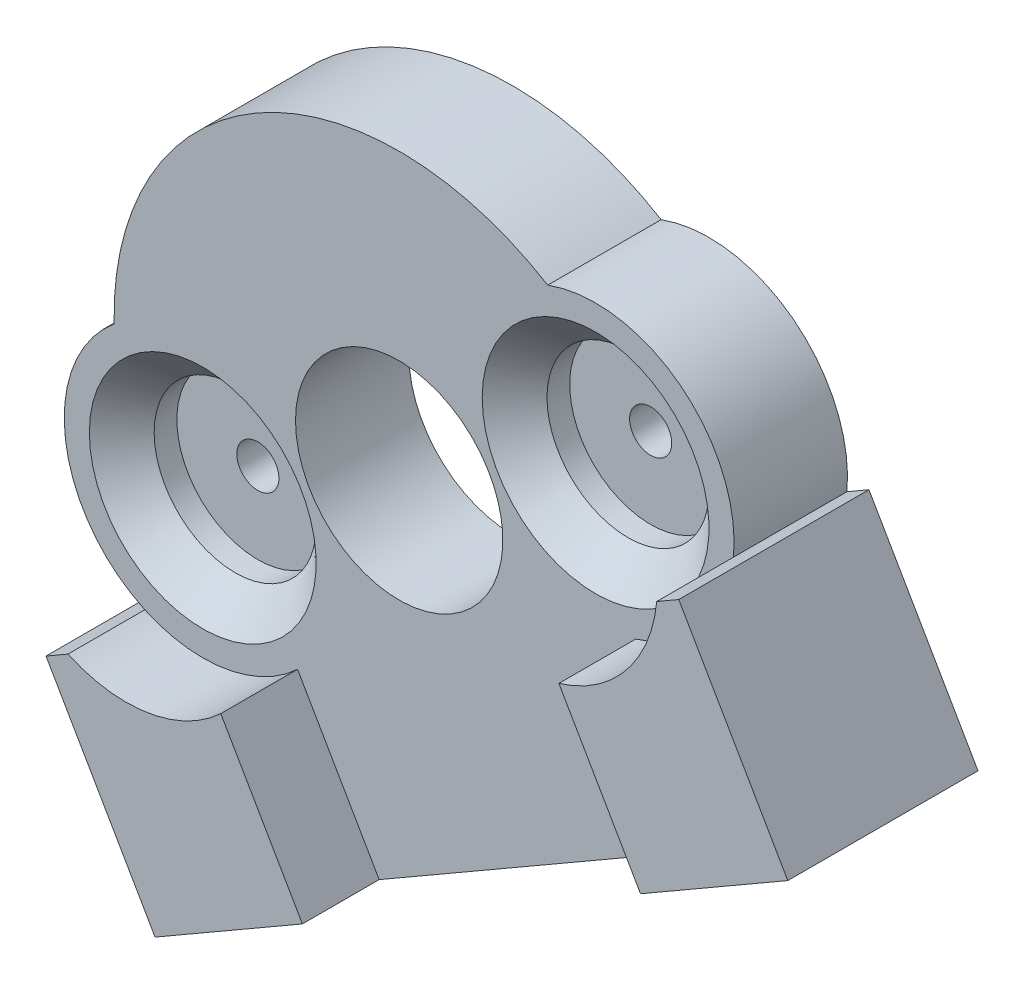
ISO-10303-21;
HEADER;
FILE_DESCRIPTION(('STEP AP214'),'2;1');
FILE_NAME('part.step','',(''),(''),'','','');
FILE_SCHEMA(('AUTOMOTIVE_DESIGN { 1 0 10303 214 1 1 1 1 }'));
ENDSEC;
DATA;
#1=APPLICATION_CONTEXT('core data for automotive mechanical design processes');
#2=APPLICATION_PROTOCOL_DEFINITION('international standard','automotive_design',2000,#1);
#3=PRODUCT_CONTEXT('',#1,'mechanical');
#4=PRODUCT('Part','Part','',(#3));
#5=PRODUCT_RELATED_PRODUCT_CATEGORY('part','',(#4));
#6=PRODUCT_DEFINITION_FORMATION('','',#4);
#7=PRODUCT_DEFINITION_CONTEXT('part definition',#1,'design');
#8=PRODUCT_DEFINITION('design','',#6,#7);
#9=PRODUCT_DEFINITION_SHAPE('','',#8);
#10=(LENGTH_UNIT() NAMED_UNIT(*) SI_UNIT(.MILLI.,.METRE.));
#11=(NAMED_UNIT(*) PLANE_ANGLE_UNIT() SI_UNIT($,.RADIAN.));
#12=(NAMED_UNIT(*) SI_UNIT($,.STERADIAN.) SOLID_ANGLE_UNIT());
#13=UNCERTAINTY_MEASURE_WITH_UNIT(LENGTH_MEASURE(1.E-05),#10,'distance_accuracy_value','');
#14=(GEOMETRIC_REPRESENTATION_CONTEXT(3) GLOBAL_UNCERTAINTY_ASSIGNED_CONTEXT((#13)) GLOBAL_UNIT_ASSIGNED_CONTEXT((#10,
#11,#12)) REPRESENTATION_CONTEXT('',''));
#15=CARTESIAN_POINT('',(0.,0.,0.));
#16=DIRECTION('',(0.,0.,1.));
#17=DIRECTION('',(1.,0.,0.));
#18=AXIS2_PLACEMENT_3D('',#15,#16,#17);
#19=CARTESIAN_POINT('',(-6.06217782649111,-3.49999999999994,5.87));
#20=DIRECTION('',(0.,0.,-1.));
#21=DIRECTION('',(-1.,0.,0.));
#22=AXIS2_PLACEMENT_3D('',#19,#20,#21);
#23=CYLINDRICAL_SURFACE('',#22,0.650000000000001);
#24=CARTESIAN_POINT('',(-6.06217782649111,-3.49999999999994,0.));
#25=DIRECTION('',(0.,0.,1.));
#26=DIRECTION('',(1.,0.,0.));
#27=AXIS2_PLACEMENT_3D('',#24,#25,#26);
#28=CIRCLE('',#27,0.650000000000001);
#29=CARTESIAN_POINT('',(-5.4121778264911,-3.49999999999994,0.));
#30=VERTEX_POINT('',#29);
#31=EDGE_CURVE('E172',#30,#30,#28,.T.);
#32=ORIENTED_EDGE('',*,*,#31,.F.);
#33=EDGE_LOOP('',(#32));
#34=FACE_BOUND('',#33,.T.);
#35=CARTESIAN_POINT('',(-6.06217782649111,-3.49999999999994,1.8));
#36=DIRECTION('',(0.,0.,1.));
#37=DIRECTION('',(1.,0.,0.));
#38=AXIS2_PLACEMENT_3D('',#35,#36,#37);
#39=CIRCLE('',#38,0.650000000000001);
#40=CARTESIAN_POINT('',(-5.4121778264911,-3.49999999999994,1.8));
#41=VERTEX_POINT('',#40);
#42=EDGE_CURVE('E241',#41,#41,#39,.T.);
#43=ORIENTED_EDGE('',*,*,#42,.T.);
#44=EDGE_LOOP('',(#43));
#45=FACE_BOUND('',#44,.T.);
#46=ADVANCED_FACE('F28',(#34,#45),#23,.F.);
#47=CARTESIAN_POINT('',(6.06217782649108,3.49999999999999,5.87));
#48=DIRECTION('',(0.,0.,-1.));
#49=DIRECTION('',(-1.,0.,0.));
#50=AXIS2_PLACEMENT_3D('',#47,#48,#49);
#51=CYLINDRICAL_SURFACE('',#50,0.650000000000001);
#52=CARTESIAN_POINT('',(6.06217782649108,3.49999999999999,0.));
#53=DIRECTION('',(0.,0.,1.));
#54=DIRECTION('',(1.,0.,0.));
#55=AXIS2_PLACEMENT_3D('',#52,#53,#54);
#56=CIRCLE('',#55,0.650000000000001);
#57=CARTESIAN_POINT('',(6.71217782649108,3.49999999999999,0.));
#58=VERTEX_POINT('',#57);
#59=EDGE_CURVE('E175',#58,#58,#56,.T.);
#60=ORIENTED_EDGE('',*,*,#59,.F.);
#61=EDGE_LOOP('',(#60));
#62=FACE_BOUND('',#61,.T.);
#63=CARTESIAN_POINT('',(6.06217782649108,3.49999999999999,1.8));
#64=DIRECTION('',(0.,0.,1.));
#65=DIRECTION('',(1.,0.,0.));
#66=AXIS2_PLACEMENT_3D('',#63,#64,#65);
#67=CIRCLE('',#66,0.650000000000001);
#68=CARTESIAN_POINT('',(6.71217782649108,3.49999999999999,1.8));
#69=VERTEX_POINT('',#68);
#70=EDGE_CURVE('E236',#69,#69,#67,.T.);
#71=ORIENTED_EDGE('',*,*,#70,.T.);
#72=EDGE_LOOP('',(#71));
#73=FACE_BOUND('',#72,.T.);
#74=ADVANCED_FACE('F351',(#62,#73),#51,.F.);
#75=CARTESIAN_POINT('',(-6.06217782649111,-3.49999999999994,5.87));
#76=DIRECTION('',(0.,0.,-1.));
#77=DIRECTION('',(-1.,0.,0.));
#78=AXIS2_PLACEMENT_3D('',#75,#76,#77);
#79=PLANE('',#78);
#80=DIRECTION('',(0.500000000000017,-0.866025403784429,0.));
#81=VECTOR('',#80,1.);
#82=CARTESIAN_POINT('',(17.8907650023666,-18.9377139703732,5.87));
#83=LINE('',#82,#81);
#84=CARTESIAN_POINT('',(7.29896859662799,-0.592184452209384,5.87));
#85=VERTEX_POINT('',#84);
#86=CARTESIAN_POINT('',(9.81780305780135,-4.95493371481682,5.87));
#87=VERTEX_POINT('',#86);
#88=EDGE_CURVE('E156',#85,#87,#83,.T.);
#89=ORIENTED_EDGE('',*,*,#88,.T.);
#90=DIRECTION('',(0.866025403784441,0.499999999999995,0.));
#91=VECTOR('',#90,1.);
#92=CARTESIAN_POINT('',(14.3644364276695,-2.32993371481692,5.87));
#93=LINE('',#92,#91);
#94=CARTESIAN_POINT('',(14.3644364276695,-2.32993371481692,5.87));
#95=VERTEX_POINT('',#94);
#96=EDGE_CURVE('E205',#87,#95,#93,.T.);
#97=ORIENTED_EDGE('',*,*,#96,.T.);
#98=DIRECTION('',(-0.499999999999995,0.866025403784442,0.));
#99=VECTOR('',#98,1.);
#100=CARTESIAN_POINT('',(14.3644364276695,-2.32993371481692,5.87));
#101=LINE('',#100,#99);
#102=CARTESIAN_POINT('',(10.9985226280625,3.49999999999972,5.87));
#103=VERTEX_POINT('',#102);
#104=EDGE_CURVE('E51',#95,#103,#101,.T.);
#105=ORIENTED_EDGE('',*,*,#104,.T.);
#106=DIRECTION('',(-0.866025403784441,-0.499999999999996,0.));
#107=VECTOR('',#106,1.);
#108=CARTESIAN_POINT('',(10.9985226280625,3.49999999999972,5.87));
#109=LINE('',#108,#107);
#110=CARTESIAN_POINT('',(10.3191455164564,3.10776144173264,5.87));
#111=VERTEX_POINT('',#110);
#112=EDGE_CURVE('E210',#103,#111,#109,.T.);
#113=ORIENTED_EDGE('',*,*,#112,.T.);
#114=CARTESIAN_POINT('',(6.06217782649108,3.49999999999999,5.87));
#115=DIRECTION('',(0.,0.,1.));
#116=DIRECTION('',(1.,0.,0.));
#117=AXIS2_PLACEMENT_3D('',#114,#115,#116);
#118=CIRCLE('',#117,4.275);
#119=EDGE_CURVE('E151',#111,#85,#118,.F.);
#120=ORIENTED_EDGE('',*,*,#119,.T.);
#121=EDGE_LOOP('',(#89,#97,#105,#113,#120));
#122=FACE_BOUND('',#121,.T.);
#123=ADVANCED_FACE('F300',(#122),#79,.F.);
#124=CARTESIAN_POINT('',(-6.06217782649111,-3.49999999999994,0.));
#125=DIRECTION('',(0.,0.,-1.));
#126=DIRECTION('',(-1.,0.,0.));
#127=AXIS2_PLACEMENT_3D('',#124,#125,#126);
#128=PLANE('',#127);
#129=CARTESIAN_POINT('',(0.,7.,0.));
#130=DIRECTION('',(0.,0.,-1.));
#131=DIRECTION('',(-1.,0.,0.));
#132=AXIS2_PLACEMENT_3D('',#129,#130,#131);
#133=CIRCLE('',#132,0.65);
#134=CARTESIAN_POINT('',(-0.65,7.,0.));
#135=VERTEX_POINT('',#134);
#136=EDGE_CURVE('E166',#135,#135,#133,.T.);
#137=ORIENTED_EDGE('',*,*,#136,.F.);
#138=EDGE_LOOP('',(#137));
#139=FACE_BOUND('',#138,.T.);
#140=ORIENTED_EDGE('',*,*,#59,.T.);
#141=EDGE_LOOP('',(#140));
#142=FACE_BOUND('',#141,.T.);
#143=CARTESIAN_POINT('',(-6.06217782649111,-3.49999999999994,0.));
#144=DIRECTION('',(0.,0.,1.));
#145=DIRECTION('',(-1.,0.,0.));
#146=AXIS2_PLACEMENT_3D('',#143,#144,#145);
#147=CIRCLE('',#146,4.275);
#148=CARTESIAN_POINT('',(-8.79738449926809,-0.214536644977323,0.));
#149=VERTEX_POINT('',#148);
#150=CARTESIAN_POINT('',(-7.85097311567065,-7.38276144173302,0.));
#151=VERTEX_POINT('',#150);
#152=EDGE_CURVE('E181',#149,#151,#147,.T.);
#153=ORIENTED_EDGE('',*,*,#152,.F.);
#154=CARTESIAN_POINT('',(0.,0.,0.));
#155=DIRECTION('',(0.,0.,1.));
#156=DIRECTION('',(1.,0.,0.));
#157=AXIS2_PLACEMENT_3D('',#154,#155,#156);
#158=CIRCLE('',#157,8.80000000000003);
#159=CARTESIAN_POINT('',(4.58448643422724,7.51149014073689,0.));
#160=VERTEX_POINT('',#159);
#161=EDGE_CURVE('E198',#160,#149,#158,.T.);
#162=ORIENTED_EDGE('',*,*,#161,.F.);
#163=CARTESIAN_POINT('',(6.06217782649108,3.49999999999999,0.));
#164=DIRECTION('',(0.,0.,1.));
#165=DIRECTION('',(1.,0.,0.));
#166=AXIS2_PLACEMENT_3D('',#163,#164,#165);
#167=CIRCLE('',#166,4.275);
#168=CARTESIAN_POINT('',(10.3191455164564,3.10776144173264,0.));
#169=VERTEX_POINT('',#168);
#170=EDGE_CURVE('E195',#169,#160,#167,.T.);
#171=ORIENTED_EDGE('',*,*,#170,.F.);
#172=DIRECTION('',(-0.866025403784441,-0.499999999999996,0.));
#173=VECTOR('',#172,1.);
#174=CARTESIAN_POINT('',(10.9985226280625,3.49999999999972,0.));
#175=LINE('',#174,#173);
#176=CARTESIAN_POINT('',(10.9985226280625,3.49999999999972,0.));
#177=VERTEX_POINT('',#176);
#178=EDGE_CURVE('E192',#177,#169,#175,.T.);
#179=ORIENTED_EDGE('',*,*,#178,.F.);
#180=DIRECTION('',(-0.499999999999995,0.866025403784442,0.));
#181=VECTOR('',#180,1.);
#182=CARTESIAN_POINT('',(14.3644364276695,-2.32993371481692,0.));
#183=LINE('',#182,#181);
#184=CARTESIAN_POINT('',(14.3644364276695,-2.32993371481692,0.));
#185=VERTEX_POINT('',#184);
#186=EDGE_CURVE('E190',#185,#177,#183,.T.);
#187=ORIENTED_EDGE('',*,*,#186,.F.);
#188=DIRECTION('',(0.866025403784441,0.499999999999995,0.));
#189=VECTOR('',#188,1.);
#190=CARTESIAN_POINT('',(14.3644364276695,-2.32993371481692,0.));
#191=LINE('',#190,#189);
#192=CARTESIAN_POINT('',(-5.16443642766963,-13.6049337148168,0.));
#193=VERTEX_POINT('',#192);
#194=EDGE_CURVE('E188',#193,#185,#191,.T.);
#195=ORIENTED_EDGE('',*,*,#194,.F.);
#196=DIRECTION('',(0.499999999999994,-0.866025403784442,0.));
#197=VECTOR('',#196,1.);
#198=CARTESIAN_POINT('',(-5.16443642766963,-13.6049337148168,0.));
#199=LINE('',#198,#197);
#200=CARTESIAN_POINT('',(-8.53035022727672,-7.77500000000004,0.));
#201=VERTEX_POINT('',#200);
#202=EDGE_CURVE('E186',#201,#193,#199,.T.);
#203=ORIENTED_EDGE('',*,*,#202,.F.);
#204=DIRECTION('',(-0.866025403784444,-0.49999999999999,0.));
#205=VECTOR('',#204,1.);
#206=CARTESIAN_POINT('',(-8.53035022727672,-7.77500000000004,0.));
#207=LINE('',#206,#205);
#208=EDGE_CURVE('E184',#151,#201,#207,.T.);
#209=ORIENTED_EDGE('',*,*,#208,.F.);
#210=EDGE_LOOP('',(#153,#162,#171,#179,#187,#195,#203,#209));
#211=FACE_BOUND('',#210,.T.);
#212=CARTESIAN_POINT('',(0.,0.,0.));
#213=DIRECTION('',(0.,0.,1.));
#214=DIRECTION('',(1.,0.,0.));
#215=AXIS2_PLACEMENT_3D('',#212,#213,#214);
#216=CIRCLE('',#215,3.2);
#217=CARTESIAN_POINT('',(3.2,0.,0.));
#218=VERTEX_POINT('',#217);
#219=EDGE_CURVE('E178',#218,#218,#216,.T.);
#220=ORIENTED_EDGE('',*,*,#219,.T.);
#221=EDGE_LOOP('',(#220));
#222=FACE_BOUND('',#221,.T.);
#223=ORIENTED_EDGE('',*,*,#31,.T.);
#224=EDGE_LOOP('',(#223));
#225=FACE_BOUND('',#224,.T.);
#226=CARTESIAN_POINT('',(0.,-7.,0.));
#227=DIRECTION('',(0.,0.,-1.));
#228=DIRECTION('',(-1.,0.,0.));
#229=AXIS2_PLACEMENT_3D('',#226,#227,#228);
#230=CIRCLE('',#229,0.65);
#231=CARTESIAN_POINT('',(-0.650000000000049,-7.,0.));
#232=VERTEX_POINT('',#231);
#233=EDGE_CURVE('E160',#232,#232,#230,.T.);
#234=ORIENTED_EDGE('',*,*,#233,.F.);
#235=EDGE_LOOP('',(#234));
#236=FACE_BOUND('',#235,.T.);
#237=ADVANCED_FACE('F338',(#139,#142,#211,#222,#225,#236),#128,.T.);
#238=CARTESIAN_POINT('',(-5.16443642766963,-13.6049337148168,5.87));
#239=VERTEX_POINT('',#238);
#240=CARTESIAN_POINT('',(-0.617803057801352,-10.9799337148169,5.87));
#241=VERTEX_POINT('',#240);
#242=EDGE_CURVE('E206',#239,#241,#93,.T.);
#243=ORIENTED_EDGE('',*,*,#242,.T.);
#244=DIRECTION('',(0.499999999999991,-0.866025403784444,0.));
#245=VECTOR('',#244,1.);
#246=CARTESIAN_POINT('',(7.45515888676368,-24.9627139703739,5.87));
#247=LINE('',#246,#245);
#248=CARTESIAN_POINT('',(-3.13663751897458,-6.61718445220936,5.87));
#249=VERTEX_POINT('',#248);
#250=EDGE_CURVE('E288',#249,#241,#247,.T.);
#251=ORIENTED_EDGE('',*,*,#250,.F.);
#252=CARTESIAN_POINT('',(-6.06217782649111,-3.49999999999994,5.87));
#253=DIRECTION('',(0.,0.,1.));
#254=DIRECTION('',(1.,0.,0.));
#255=AXIS2_PLACEMENT_3D('',#252,#253,#254);
#256=CIRCLE('',#255,4.275);
#257=CARTESIAN_POINT('',(-7.85097311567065,-7.38276144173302,5.87));
#258=VERTEX_POINT('',#257);
#259=EDGE_CURVE('E150',#258,#249,#256,.T.);
#260=ORIENTED_EDGE('',*,*,#259,.F.);
#261=DIRECTION('',(-0.866025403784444,-0.49999999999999,0.));
#262=VECTOR('',#261,1.);
#263=CARTESIAN_POINT('',(-8.53035022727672,-7.77500000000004,5.87));
#264=LINE('',#263,#262);
#265=CARTESIAN_POINT('',(-8.53035022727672,-7.77500000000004,5.87));
#266=VERTEX_POINT('',#265);
#267=EDGE_CURVE('E201',#258,#266,#264,.T.);
#268=ORIENTED_EDGE('',*,*,#267,.T.);
#269=DIRECTION('',(0.499999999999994,-0.866025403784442,0.));
#270=VECTOR('',#269,1.);
#271=CARTESIAN_POINT('',(-5.16443642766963,-13.6049337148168,5.87));
#272=LINE('',#271,#270);
#273=EDGE_CURVE('E203',#266,#239,#272,.T.);
#274=ORIENTED_EDGE('',*,*,#273,.T.);
#275=EDGE_LOOP('',(#243,#251,#260,#268,#274));
#276=FACE_BOUND('',#275,.T.);
#277=ADVANCED_FACE('F331',(#276),#79,.F.);
#278=CARTESIAN_POINT('',(-6.06217782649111,-3.49999999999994,5.87));
#279=DIRECTION('',(0.,0.,-1.));
#280=DIRECTION('',(-1.,0.,0.));
#281=AXIS2_PLACEMENT_3D('',#278,#279,#280);
#282=CYLINDRICAL_SURFACE('',#281,4.275);
#283=DIRECTION('',(0.,0.,-1.));
#284=VECTOR('',#283,1.);
#285=CARTESIAN_POINT('',(-7.85097311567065,-7.38276144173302,5.87));
#286=LINE('',#285,#284);
#287=CARTESIAN_POINT('',(-7.85097311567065,-7.38276144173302,3.5));
#288=VERTEX_POINT('',#287);
#289=EDGE_CURVE('E231',#288,#151,#286,.T.);
#290=ORIENTED_EDGE('',*,*,#289,.F.);
#291=CARTESIAN_POINT('',(-6.06217782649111,-3.49999999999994,3.5));
#292=DIRECTION('',(0.,0.,-1.));
#293=DIRECTION('',(-1.,0.,0.));
#294=AXIS2_PLACEMENT_3D('',#291,#292,#293);
#295=CIRCLE('',#294,4.275);
#296=CARTESIAN_POINT('',(-8.79738449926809,-0.214536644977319,3.5));
#297=VERTEX_POINT('',#296);
#298=EDGE_CURVE('E132',#297,#288,#295,.F.);
#299=ORIENTED_EDGE('',*,*,#298,.F.);
#300=DIRECTION('',(0.,0.,-1.));
#301=VECTOR('',#300,1.);
#302=CARTESIAN_POINT('',(-8.79738449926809,-0.214536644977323,5.87));
#303=LINE('',#302,#301);
#304=EDGE_CURVE('E212',#297,#149,#303,.T.);
#305=ORIENTED_EDGE('',*,*,#304,.T.);
#306=ORIENTED_EDGE('',*,*,#152,.T.);
#307=EDGE_LOOP('',(#290,#299,#305,#306));
#308=FACE_BOUND('',#307,.T.);
#309=ADVANCED_FACE('F30',(#308),#282,.T.);
#310=CARTESIAN_POINT('',(-8.53035022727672,-7.77500000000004,5.87));
#311=DIRECTION('',(0.49999999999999,-0.866025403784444,0.));
#312=DIRECTION('',(0.866025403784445,0.49999999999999,0.));
#313=AXIS2_PLACEMENT_3D('',#310,#311,#312);
#314=PLANE('',#313);
#315=ORIENTED_EDGE('',*,*,#208,.T.);
#316=DIRECTION('',(0.,0.,-1.));
#317=VECTOR('',#316,1.);
#318=CARTESIAN_POINT('',(-8.53035022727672,-7.77500000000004,5.87));
#319=LINE('',#318,#317);
#320=EDGE_CURVE('E228',#266,#201,#319,.T.);
#321=ORIENTED_EDGE('',*,*,#320,.F.);
#322=ORIENTED_EDGE('',*,*,#267,.F.);
#323=EDGE_CURVE('E232',#258,#288,#286,.T.);
#324=ORIENTED_EDGE('',*,*,#323,.T.);
#325=ORIENTED_EDGE('',*,*,#289,.T.);
#326=EDGE_LOOP('',(#315,#321,#322,#324,#325));
#327=FACE_BOUND('',#326,.T.);
#328=ADVANCED_FACE('F328',(#327),#314,.F.);
#329=CARTESIAN_POINT('',(-5.16443642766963,-13.6049337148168,5.87));
#330=DIRECTION('',(0.866025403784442,0.499999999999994,0.));
#331=DIRECTION('',(-0.499999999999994,0.866025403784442,0.));
#332=AXIS2_PLACEMENT_3D('',#329,#330,#331);
#333=PLANE('',#332);
#334=ORIENTED_EDGE('',*,*,#202,.T.);
#335=DIRECTION('',(0.,0.,-1.));
#336=VECTOR('',#335,1.);
#337=CARTESIAN_POINT('',(-5.16443642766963,-13.6049337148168,5.87));
#338=LINE('',#337,#336);
#339=EDGE_CURVE('E225',#239,#193,#338,.T.);
#340=ORIENTED_EDGE('',*,*,#339,.F.);
#341=ORIENTED_EDGE('',*,*,#273,.F.);
#342=ORIENTED_EDGE('',*,*,#320,.T.);
#343=EDGE_LOOP('',(#334,#340,#341,#342));
#344=FACE_BOUND('',#343,.T.);
#345=ADVANCED_FACE('F340',(#344),#333,.F.);
#346=CARTESIAN_POINT('',(14.3644364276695,-2.32993371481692,5.87));
#347=DIRECTION('',(-0.499999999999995,0.866025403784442,0.));
#348=DIRECTION('',(-0.866025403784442,-0.499999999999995,0.));
#349=AXIS2_PLACEMENT_3D('',#346,#347,#348);
#350=PLANE('',#349);
#351=CARTESIAN_POINT('',(0.446306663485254,-10.3655696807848,1.07240495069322));
#352=DIRECTION('',(0.499999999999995,-0.866025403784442,0.));
#353=DIRECTION('',(0.866025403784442,0.499999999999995,0.));
#354=AXIS2_PLACEMENT_3D('',#351,#352,#353);
#355=CIRCLE('',#354,0.649999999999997);
#356=CARTESIAN_POINT('',(1.00922317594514,-10.0405696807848,1.07240495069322));
#357=VERTEX_POINT('',#356);
#358=EDGE_CURVE('E596',#357,#357,#355,.T.);
#359=ORIENTED_EDGE('',*,*,#358,.F.);
#360=EDGE_LOOP('',(#359));
#361=FACE_BOUND('',#360,.T.);
#362=CARTESIAN_POINT('',(9.10656070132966,-5.36556968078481,1.07240495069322));
#363=DIRECTION('',(0.499999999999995,-0.866025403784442,0.));
#364=DIRECTION('',(0.866025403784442,0.499999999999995,0.));
#365=AXIS2_PLACEMENT_3D('',#362,#363,#364);
#366=CIRCLE('',#365,0.649999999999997);
#367=CARTESIAN_POINT('',(9.66947721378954,-5.04056968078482,1.07240495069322));
#368=VERTEX_POINT('',#367);
#369=EDGE_CURVE('E595',#368,#368,#366,.T.);
#370=ORIENTED_EDGE('',*,*,#369,.F.);
#371=EDGE_LOOP('',(#370));
#372=FACE_BOUND('',#371,.T.);
#373=CARTESIAN_POINT('',(12.3108546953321,-3.51556968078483,2.53689457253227));
#374=DIRECTION('',(0.499999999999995,-0.866025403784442,0.));
#375=DIRECTION('',(0.866025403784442,0.499999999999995,0.));
#376=AXIS2_PLACEMENT_3D('',#373,#374,#375);
#377=CIRCLE('',#376,1.18627587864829);
#378=CARTESIAN_POINT('',(13.3381997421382,-2.92243174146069,2.53689457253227));
#379=VERTEX_POINT('',#378);
#380=EDGE_CURVE('E606',#379,#379,#377,.T.);
#381=ORIENTED_EDGE('',*,*,#380,.F.);
#382=EDGE_LOOP('',(#381));
#383=FACE_BOUND('',#382,.T.);
#384=CARTESIAN_POINT('',(-2.75798733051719,-12.2155696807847,2.53689457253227));
#385=DIRECTION('',(0.499999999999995,-0.866025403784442,0.));
#386=DIRECTION('',(0.866025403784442,0.499999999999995,0.));
#387=AXIS2_PLACEMENT_3D('',#384,#385,#386);
#388=CIRCLE('',#387,1.2);
#389=CARTESIAN_POINT('',(-1.71875684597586,-11.6155696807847,2.53689457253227));
#390=VERTEX_POINT('',#389);
#391=EDGE_CURVE('E273',#390,#390,#388,.T.);
#392=ORIENTED_EDGE('',*,*,#391,.F.);
#393=EDGE_LOOP('',(#392));
#394=FACE_BOUND('',#393,.T.);
#395=DIRECTION('',(0.866025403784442,0.499999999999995,0.));
#396=VECTOR('',#395,1.);
#397=CARTESIAN_POINT('',(-5.36326725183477,-13.7197287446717,3.5));
#398=LINE('',#397,#396);
#399=CARTESIAN_POINT('',(-0.617803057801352,-10.9799337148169,3.5));
#400=VERTEX_POINT('',#399);
#401=CARTESIAN_POINT('',(9.81780305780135,-4.95493371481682,3.5));
#402=VERTEX_POINT('',#401);
#403=EDGE_CURVE('E239',#400,#402,#398,.T.);
#404=ORIENTED_EDGE('',*,*,#403,.F.);
#405=DIRECTION('',(0.,0.,1.));
#406=VECTOR('',#405,1.);
#407=CARTESIAN_POINT('',(-0.617803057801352,-10.9799337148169,-28.6124930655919));
#408=LINE('',#407,#406);
#409=EDGE_CURVE('E144',#400,#241,#408,.T.);
#410=ORIENTED_EDGE('',*,*,#409,.T.);
#411=ORIENTED_EDGE('',*,*,#242,.F.);
#412=ORIENTED_EDGE('',*,*,#339,.T.);
#413=ORIENTED_EDGE('',*,*,#194,.T.);
#414=DIRECTION('',(0.,0.,-1.));
#415=VECTOR('',#414,1.);
#416=CARTESIAN_POINT('',(14.3644364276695,-2.32993371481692,5.87));
#417=LINE('',#416,#415);
#418=EDGE_CURVE('E222',#95,#185,#417,.T.);
#419=ORIENTED_EDGE('',*,*,#418,.F.);
#420=ORIENTED_EDGE('',*,*,#96,.F.);
#421=DIRECTION('',(0.,0.,1.));
#422=VECTOR('',#421,1.);
#423=CARTESIAN_POINT('',(9.81780305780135,-4.95493371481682,-28.6124930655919));
#424=LINE('',#423,#422);
#425=EDGE_CURVE('E153',#402,#87,#424,.T.);
#426=ORIENTED_EDGE('',*,*,#425,.F.);
#427=EDGE_LOOP('',(#404,#410,#411,#412,#413,#419,#420,#426));
#428=FACE_BOUND('',#427,.T.);
#429=ADVANCED_FACE('F302',(#361,#372,#383,#394,#428),#350,.F.);
#430=CARTESIAN_POINT('',(14.3644364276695,-2.32993371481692,5.87));
#431=DIRECTION('',(-0.866025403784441,-0.499999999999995,0.));
#432=DIRECTION('',(0.499999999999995,-0.866025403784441,0.));
#433=AXIS2_PLACEMENT_3D('',#430,#431,#432);
#434=PLANE('',#433);
#435=ORIENTED_EDGE('',*,*,#186,.T.);
#436=DIRECTION('',(0.,0.,-1.));
#437=VECTOR('',#436,1.);
#438=CARTESIAN_POINT('',(10.9985226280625,3.49999999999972,5.87));
#439=LINE('',#438,#437);
#440=EDGE_CURVE('E219',#103,#177,#439,.T.);
#441=ORIENTED_EDGE('',*,*,#440,.F.);
#442=ORIENTED_EDGE('',*,*,#104,.F.);
#443=ORIENTED_EDGE('',*,*,#418,.T.);
#444=EDGE_LOOP('',(#435,#441,#442,#443));
#445=FACE_BOUND('',#444,.T.);
#446=ADVANCED_FACE('F306',(#445),#434,.F.);
#447=CARTESIAN_POINT('',(10.9985226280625,3.49999999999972,5.87));
#448=DIRECTION('',(0.499999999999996,-0.866025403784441,0.));
#449=DIRECTION('',(0.866025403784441,0.499999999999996,0.));
#450=AXIS2_PLACEMENT_3D('',#447,#448,#449);
#451=PLANE('',#450);
#452=ORIENTED_EDGE('',*,*,#178,.T.);
#453=DIRECTION('',(0.,0.,-1.));
#454=VECTOR('',#453,1.);
#455=CARTESIAN_POINT('',(10.3191455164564,3.10776144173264,5.87));
#456=LINE('',#455,#454);
#457=CARTESIAN_POINT('',(10.3191455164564,3.10776144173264,3.5));
#458=VERTEX_POINT('',#457);
#459=EDGE_CURVE('E216',#458,#169,#456,.T.);
#460=ORIENTED_EDGE('',*,*,#459,.F.);
#461=EDGE_CURVE('E217',#111,#458,#456,.T.);
#462=ORIENTED_EDGE('',*,*,#461,.F.);
#463=ORIENTED_EDGE('',*,*,#112,.F.);
#464=ORIENTED_EDGE('',*,*,#440,.T.);
#465=EDGE_LOOP('',(#452,#460,#462,#463,#464));
#466=FACE_BOUND('',#465,.T.);
#467=ADVANCED_FACE('F311',(#466),#451,.F.);
#468=CARTESIAN_POINT('',(6.06217782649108,3.49999999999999,5.87));
#469=DIRECTION('',(0.,0.,-1.));
#470=DIRECTION('',(-1.,0.,0.));
#471=AXIS2_PLACEMENT_3D('',#468,#469,#470);
#472=CYLINDRICAL_SURFACE('',#471,4.275);
#473=DIRECTION('',(0.,0.,-1.));
#474=VECTOR('',#473,1.);
#475=CARTESIAN_POINT('',(4.58448643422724,7.51149014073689,5.87));
#476=LINE('',#475,#474);
#477=CARTESIAN_POINT('',(4.58448643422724,7.51149014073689,3.5));
#478=VERTEX_POINT('',#477);
#479=EDGE_CURVE('E214',#478,#160,#476,.T.);
#480=ORIENTED_EDGE('',*,*,#479,.F.);
#481=CARTESIAN_POINT('',(6.06217782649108,3.49999999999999,3.5));
#482=DIRECTION('',(0.,0.,-1.));
#483=DIRECTION('',(-1.,0.,0.));
#484=AXIS2_PLACEMENT_3D('',#481,#482,#483);
#485=CIRCLE('',#484,4.275);
#486=EDGE_CURVE('E43',#478,#458,#485,.T.);
#487=ORIENTED_EDGE('',*,*,#486,.T.);
#488=ORIENTED_EDGE('',*,*,#459,.T.);
#489=ORIENTED_EDGE('',*,*,#170,.T.);
#490=EDGE_LOOP('',(#480,#487,#488,#489));
#491=FACE_BOUND('',#490,.T.);
#492=ADVANCED_FACE('F317',(#491),#472,.T.);
#493=CARTESIAN_POINT('',(0.,0.,5.87));
#494=DIRECTION('',(0.,0.,-1.));
#495=DIRECTION('',(-1.,0.,0.));
#496=AXIS2_PLACEMENT_3D('',#493,#494,#495);
#497=CYLINDRICAL_SURFACE('',#496,8.80000000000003);
#498=ORIENTED_EDGE('',*,*,#304,.F.);
#499=CARTESIAN_POINT('',(0.,0.,3.5));
#500=DIRECTION('',(0.,0.,-1.));
#501=DIRECTION('',(-1.,0.,0.));
#502=AXIS2_PLACEMENT_3D('',#499,#500,#501);
#503=CIRCLE('',#502,8.80000000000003);
#504=EDGE_CURVE('E136',#478,#297,#503,.F.);
#505=ORIENTED_EDGE('',*,*,#504,.F.);
#506=ORIENTED_EDGE('',*,*,#479,.T.);
#507=ORIENTED_EDGE('',*,*,#161,.T.);
#508=EDGE_LOOP('',(#498,#505,#506,#507));
#509=FACE_BOUND('',#508,.T.);
#510=ADVANCED_FACE('F322',(#509),#497,.T.);
#511=CARTESIAN_POINT('',(0.,0.,5.87));
#512=DIRECTION('',(0.,0.,-1.));
#513=DIRECTION('',(-1.,0.,0.));
#514=AXIS2_PLACEMENT_3D('',#511,#512,#513);
#515=CYLINDRICAL_SURFACE('',#514,3.2);
#516=CARTESIAN_POINT('',(0.,0.,3.5));
#517=DIRECTION('',(0.,0.,-1.));
#518=DIRECTION('',(-1.,0.,0.));
#519=AXIS2_PLACEMENT_3D('',#516,#517,#518);
#520=CIRCLE('',#519,3.2);
#521=CARTESIAN_POINT('',(-3.2,0.,3.5));
#522=VERTEX_POINT('',#521);
#523=EDGE_CURVE('E145',#522,#522,#520,.F.);
#524=ORIENTED_EDGE('',*,*,#523,.T.);
#525=EDGE_LOOP('',(#524));
#526=FACE_BOUND('',#525,.T.);
#527=ORIENTED_EDGE('',*,*,#219,.F.);
#528=EDGE_LOOP('',(#527));
#529=FACE_BOUND('',#528,.T.);
#530=ADVANCED_FACE('F366',(#526,#529),#515,.F.);
#531=CARTESIAN_POINT('',(0.,7.,-1.));
#532=DIRECTION('',(0.,0.,1.));
#533=DIRECTION('',(1.,0.,0.));
#534=AXIS2_PLACEMENT_3D('',#531,#532,#533);
#535=CYLINDRICAL_SURFACE('',#534,0.65);
#536=CARTESIAN_POINT('',(0.,7.,-1.));
#537=DIRECTION('',(0.,0.,-1.));
#538=DIRECTION('',(-1.,0.,0.));
#539=AXIS2_PLACEMENT_3D('',#536,#537,#538);
#540=CIRCLE('',#539,0.65);
#541=CARTESIAN_POINT('',(-0.65,7.,-1.));
#542=VERTEX_POINT('',#541);
#543=EDGE_CURVE('E169',#542,#542,#540,.T.);
#544=ORIENTED_EDGE('',*,*,#543,.F.);
#545=EDGE_LOOP('',(#544));
#546=FACE_BOUND('',#545,.T.);
#547=ORIENTED_EDGE('',*,*,#136,.T.);
#548=EDGE_LOOP('',(#547));
#549=FACE_BOUND('',#548,.T.);
#550=ADVANCED_FACE('F363',(#546,#549),#535,.T.);
#551=CARTESIAN_POINT('',(0.,7.,-1.));
#552=DIRECTION('',(0.,0.,-1.));
#553=DIRECTION('',(-1.,0.,0.));
#554=AXIS2_PLACEMENT_3D('',#551,#552,#553);
#555=PLANE('',#554);
#556=ORIENTED_EDGE('',*,*,#543,.T.);
#557=EDGE_LOOP('',(#556));
#558=FACE_BOUND('',#557,.T.);
#559=ADVANCED_FACE('F396',(#558),#555,.T.);
#560=CARTESIAN_POINT('',(0.,-7.,-1.));
#561=DIRECTION('',(0.,0.,1.));
#562=DIRECTION('',(1.,0.,0.));
#563=AXIS2_PLACEMENT_3D('',#560,#561,#562);
#564=CYLINDRICAL_SURFACE('',#563,0.65);
#565=CARTESIAN_POINT('',(0.,-7.,-1.));
#566=DIRECTION('',(0.,0.,-1.));
#567=DIRECTION('',(-1.,0.,0.));
#568=AXIS2_PLACEMENT_3D('',#565,#566,#567);
#569=CIRCLE('',#568,0.65);
#570=CARTESIAN_POINT('',(-0.650000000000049,-7.,-1.));
#571=VERTEX_POINT('',#570);
#572=EDGE_CURVE('E163',#571,#571,#569,.T.);
#573=ORIENTED_EDGE('',*,*,#572,.F.);
#574=EDGE_LOOP('',(#573));
#575=FACE_BOUND('',#574,.T.);
#576=ORIENTED_EDGE('',*,*,#233,.T.);
#577=EDGE_LOOP('',(#576));
#578=FACE_BOUND('',#577,.T.);
#579=ADVANCED_FACE('F403',(#575,#578),#564,.T.);
#580=CARTESIAN_POINT('',(0.,-7.,-1.));
#581=DIRECTION('',(0.,0.,-1.));
#582=DIRECTION('',(-1.,0.,0.));
#583=AXIS2_PLACEMENT_3D('',#580,#581,#582);
#584=PLANE('',#583);
#585=ORIENTED_EDGE('',*,*,#572,.T.);
#586=EDGE_LOOP('',(#585));
#587=FACE_BOUND('',#586,.T.);
#588=ADVANCED_FACE('F410',(#587),#584,.T.);
#589=CARTESIAN_POINT('',(6.06217782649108,3.49999999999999,-28.6124930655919));
#590=DIRECTION('',(0.,0.,1.));
#591=DIRECTION('',(1.,0.,0.));
#592=AXIS2_PLACEMENT_3D('',#589,#590,#591);
#593=CYLINDRICAL_SURFACE('',#592,4.275);
#594=ORIENTED_EDGE('',*,*,#461,.T.);
#595=CARTESIAN_POINT('',(7.29896859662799,-0.59218445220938,3.5));
#596=VERTEX_POINT('',#595);
#597=EDGE_CURVE('E282',#458,#596,#485,.T.);
#598=ORIENTED_EDGE('',*,*,#597,.T.);
#599=DIRECTION('',(0.,0.,1.));
#600=VECTOR('',#599,1.);
#601=CARTESIAN_POINT('',(7.29896859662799,-0.592184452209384,-28.6124930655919));
#602=LINE('',#601,#600);
#603=EDGE_CURVE('E146',#596,#85,#602,.T.);
#604=ORIENTED_EDGE('',*,*,#603,.T.);
#605=ORIENTED_EDGE('',*,*,#119,.F.);
#606=EDGE_LOOP('',(#594,#598,#604,#605));
#607=FACE_BOUND('',#606,.T.);
#608=ADVANCED_FACE('F314',(#607),#593,.F.);
#609=CARTESIAN_POINT('',(-6.06217782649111,-3.49999999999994,-28.6124930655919));
#610=DIRECTION('',(0.,0.,1.));
#611=DIRECTION('',(1.,0.,0.));
#612=AXIS2_PLACEMENT_3D('',#609,#610,#611);
#613=CYLINDRICAL_SURFACE('',#612,4.275);
#614=ORIENTED_EDGE('',*,*,#259,.T.);
#615=DIRECTION('',(0.,0.,1.));
#616=VECTOR('',#615,1.);
#617=CARTESIAN_POINT('',(-3.13663751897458,-6.61718445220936,-28.6124930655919));
#618=LINE('',#617,#616);
#619=CARTESIAN_POINT('',(-3.13663751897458,-6.61718445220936,3.5));
#620=VERTEX_POINT('',#619);
#621=EDGE_CURVE('E141',#620,#249,#618,.T.);
#622=ORIENTED_EDGE('',*,*,#621,.F.);
#623=EDGE_CURVE('E124',#288,#620,#295,.F.);
#624=ORIENTED_EDGE('',*,*,#623,.F.);
#625=ORIENTED_EDGE('',*,*,#323,.F.);
#626=EDGE_LOOP('',(#614,#622,#624,#625));
#627=FACE_BOUND('',#626,.T.);
#628=ADVANCED_FACE('F148',(#627),#613,.F.);
#629=CARTESIAN_POINT('',(7.45515888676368,-24.9627139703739,-28.6124930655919));
#630=DIRECTION('',(-0.866025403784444,-0.499999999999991,0.));
#631=DIRECTION('',(0.499999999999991,-0.866025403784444,0.));
#632=AXIS2_PLACEMENT_3D('',#629,#630,#631);
#633=PLANE('',#632);
#634=ORIENTED_EDGE('',*,*,#621,.T.);
#635=ORIENTED_EDGE('',*,*,#250,.T.);
#636=ORIENTED_EDGE('',*,*,#409,.F.);
#637=DIRECTION('',(0.499999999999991,-0.866025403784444,0.));
#638=VECTOR('',#637,1.);
#639=CARTESIAN_POINT('',(7.45515888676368,-24.9627139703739,3.5));
#640=LINE('',#639,#638);
#641=EDGE_CURVE('E129',#620,#400,#640,.T.);
#642=ORIENTED_EDGE('',*,*,#641,.F.);
#643=EDGE_LOOP('',(#634,#635,#636,#642));
#644=FACE_BOUND('',#643,.T.);
#645=ADVANCED_FACE('F140',(#644),#633,.F.);
#646=CARTESIAN_POINT('',(17.8907650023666,-18.9377139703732,-28.6124930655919));
#647=DIRECTION('',(-0.866025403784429,-0.500000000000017,0.));
#648=DIRECTION('',(0.500000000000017,-0.866025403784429,0.));
#649=AXIS2_PLACEMENT_3D('',#646,#647,#648);
#650=PLANE('',#649);
#651=DIRECTION('',(0.500000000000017,-0.866025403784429,0.));
#652=VECTOR('',#651,1.);
#653=CARTESIAN_POINT('',(17.8907650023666,-18.9377139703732,3.5));
#654=LINE('',#653,#652);
#655=EDGE_CURVE('E280',#596,#402,#654,.T.);
#656=ORIENTED_EDGE('',*,*,#655,.T.);
#657=ORIENTED_EDGE('',*,*,#425,.T.);
#658=ORIENTED_EDGE('',*,*,#88,.F.);
#659=ORIENTED_EDGE('',*,*,#603,.F.);
#660=EDGE_LOOP('',(#656,#657,#658,#659));
#661=FACE_BOUND('',#660,.T.);
#662=ADVANCED_FACE('F295',(#661),#650,.T.);
#663=CARTESIAN_POINT('',(-6.06217782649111,-3.49999999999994,3.5));
#664=DIRECTION('',(0.,0.,-1.));
#665=DIRECTION('',(-1.,0.,0.));
#666=AXIS2_PLACEMENT_3D('',#663,#664,#665);
#667=PLANE('',#666);
#668=CARTESIAN_POINT('',(-6.06217782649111,-3.49999999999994,3.5));
#669=DIRECTION('',(0.,0.,-1.));
#670=DIRECTION('',(-1.,0.,0.));
#671=AXIS2_PLACEMENT_3D('',#668,#669,#670);
#672=CIRCLE('',#671,3.5);
#673=CARTESIAN_POINT('',(-9.56217782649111,-3.49999999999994,3.5));
#674=VERTEX_POINT('',#673);
#675=EDGE_CURVE('E36',#674,#674,#672,.T.);
#676=ORIENTED_EDGE('',*,*,#675,.T.);
#677=EDGE_LOOP('',(#676));
#678=FACE_BOUND('',#677,.T.);
#679=CARTESIAN_POINT('',(6.06217782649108,3.49999999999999,3.5));
#680=DIRECTION('',(0.,0.,-1.));
#681=DIRECTION('',(-1.,0.,0.));
#682=AXIS2_PLACEMENT_3D('',#679,#680,#681);
#683=CIRCLE('',#682,3.5);
#684=CARTESIAN_POINT('',(2.56217782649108,3.49999999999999,3.5));
#685=VERTEX_POINT('',#684);
#686=EDGE_CURVE('E247',#685,#685,#683,.T.);
#687=ORIENTED_EDGE('',*,*,#686,.T.);
#688=EDGE_LOOP('',(#687));
#689=FACE_BOUND('',#688,.T.);
#690=ORIENTED_EDGE('',*,*,#298,.T.);
#691=ORIENTED_EDGE('',*,*,#623,.T.);
#692=ORIENTED_EDGE('',*,*,#641,.T.);
#693=ORIENTED_EDGE('',*,*,#403,.T.);
#694=ORIENTED_EDGE('',*,*,#655,.F.);
#695=ORIENTED_EDGE('',*,*,#597,.F.);
#696=ORIENTED_EDGE('',*,*,#486,.F.);
#697=ORIENTED_EDGE('',*,*,#504,.T.);
#698=EDGE_LOOP('',(#690,#691,#692,#693,#694,#695,#696,#697));
#699=FACE_BOUND('',#698,.T.);
#700=ORIENTED_EDGE('',*,*,#523,.F.);
#701=EDGE_LOOP('',(#700));
#702=FACE_BOUND('',#701,.T.);
#703=ADVANCED_FACE('F126',(#678,#689,#699,#702),#667,.F.);
#704=CARTESIAN_POINT('',(6.06217782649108,3.49999999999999,1.8));
#705=DIRECTION('',(0.,0.,1.));
#706=DIRECTION('',(1.,0.,0.));
#707=AXIS2_PLACEMENT_3D('',#704,#705,#706);
#708=CYLINDRICAL_SURFACE('',#707,2.5);
#709=CARTESIAN_POINT('',(6.06217782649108,3.49999999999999,2.5));
#710=DIRECTION('',(0.,0.,-1.));
#711=DIRECTION('',(-1.,0.,0.));
#712=AXIS2_PLACEMENT_3D('',#709,#710,#711);
#713=CIRCLE('',#712,2.5);
#714=CARTESIAN_POINT('',(3.56217782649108,3.49999999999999,2.5));
#715=VERTEX_POINT('',#714);
#716=EDGE_CURVE('E12',#715,#715,#713,.F.);
#717=ORIENTED_EDGE('',*,*,#716,.T.);
#718=EDGE_LOOP('',(#717));
#719=FACE_BOUND('',#718,.T.);
#720=CARTESIAN_POINT('',(6.06217782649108,3.49999999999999,1.8));
#721=DIRECTION('',(0.,0.,1.));
#722=DIRECTION('',(1.,0.,0.));
#723=AXIS2_PLACEMENT_3D('',#720,#721,#722);
#724=CIRCLE('',#723,2.5);
#725=CARTESIAN_POINT('',(8.56217782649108,3.49999999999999,1.8));
#726=VERTEX_POINT('',#725);
#727=EDGE_CURVE('E240',#726,#726,#724,.T.);
#728=ORIENTED_EDGE('',*,*,#727,.F.);
#729=EDGE_LOOP('',(#728));
#730=FACE_BOUND('',#729,.T.);
#731=ADVANCED_FACE('F484',(#719,#730),#708,.F.);
#732=CARTESIAN_POINT('',(6.06217782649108,3.49999999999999,1.8));
#733=DIRECTION('',(0.,0.,1.));
#734=DIRECTION('',(1.,0.,0.));
#735=AXIS2_PLACEMENT_3D('',#732,#733,#734);
#736=PLANE('',#735);
#737=ORIENTED_EDGE('',*,*,#70,.F.);
#738=EDGE_LOOP('',(#737));
#739=FACE_BOUND('',#738,.T.);
#740=ORIENTED_EDGE('',*,*,#727,.T.);
#741=EDGE_LOOP('',(#740));
#742=FACE_BOUND('',#741,.T.);
#743=ADVANCED_FACE('F265',(#739,#742),#736,.T.);
#744=CARTESIAN_POINT('',(-6.06217782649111,-3.49999999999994,1.8));
#745=DIRECTION('',(0.,0.,1.));
#746=DIRECTION('',(1.,0.,0.));
#747=AXIS2_PLACEMENT_3D('',#744,#745,#746);
#748=CYLINDRICAL_SURFACE('',#747,2.5);
#749=CARTESIAN_POINT('',(-6.06217782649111,-3.49999999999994,2.5));
#750=DIRECTION('',(0.,0.,-1.));
#751=DIRECTION('',(-1.,0.,0.));
#752=AXIS2_PLACEMENT_3D('',#749,#750,#751);
#753=CIRCLE('',#752,2.5);
#754=CARTESIAN_POINT('',(-8.56217782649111,-3.49999999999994,2.5));
#755=VERTEX_POINT('',#754);
#756=EDGE_CURVE('E235',#755,#755,#753,.F.);
#757=ORIENTED_EDGE('',*,*,#756,.T.);
#758=EDGE_LOOP('',(#757));
#759=FACE_BOUND('',#758,.T.);
#760=CARTESIAN_POINT('',(-6.06217782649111,-3.49999999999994,1.8));
#761=DIRECTION('',(0.,0.,1.));
#762=DIRECTION('',(1.,0.,0.));
#763=AXIS2_PLACEMENT_3D('',#760,#761,#762);
#764=CIRCLE('',#763,2.5);
#765=CARTESIAN_POINT('',(-3.5621778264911,-3.49999999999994,1.8));
#766=VERTEX_POINT('',#765);
#767=EDGE_CURVE('E244',#766,#766,#764,.T.);
#768=ORIENTED_EDGE('',*,*,#767,.F.);
#769=EDGE_LOOP('',(#768));
#770=FACE_BOUND('',#769,.T.);
#771=ADVANCED_FACE('F262',(#759,#770),#748,.F.);
#772=CARTESIAN_POINT('',(-6.06217782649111,-3.49999999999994,1.8));
#773=DIRECTION('',(0.,0.,1.));
#774=DIRECTION('',(1.,0.,0.));
#775=AXIS2_PLACEMENT_3D('',#772,#773,#774);
#776=PLANE('',#775);
#777=ORIENTED_EDGE('',*,*,#42,.F.);
#778=EDGE_LOOP('',(#777));
#779=FACE_BOUND('',#778,.T.);
#780=ORIENTED_EDGE('',*,*,#767,.T.);
#781=EDGE_LOOP('',(#780));
#782=FACE_BOUND('',#781,.T.);
#783=ADVANCED_FACE('F258',(#779,#782),#776,.T.);
#784=CARTESIAN_POINT('',(-6.06217782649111,-3.49999999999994,2.5));
#785=DIRECTION('',(0.,0.,1.));
#786=DIRECTION('',(1.,0.,0.));
#787=AXIS2_PLACEMENT_3D('',#784,#785,#786);
#788=CONICAL_SURFACE('',#787,2.5,0.785398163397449);
#789=ORIENTED_EDGE('',*,*,#675,.F.);
#790=EDGE_LOOP('',(#789));
#791=FACE_BOUND('',#790,.T.);
#792=ORIENTED_EDGE('',*,*,#756,.F.);
#793=EDGE_LOOP('',(#792));
#794=FACE_BOUND('',#793,.T.);
#795=ADVANCED_FACE('F254',(#791,#794),#788,.F.);
#796=CARTESIAN_POINT('',(6.06217782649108,3.49999999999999,2.5));
#797=DIRECTION('',(0.,0.,1.));
#798=DIRECTION('',(1.,0.,0.));
#799=AXIS2_PLACEMENT_3D('',#796,#797,#798);
#800=CONICAL_SURFACE('',#799,2.5,0.785398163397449);
#801=ORIENTED_EDGE('',*,*,#686,.F.);
#802=EDGE_LOOP('',(#801));
#803=FACE_BOUND('',#802,.T.);
#804=ORIENTED_EDGE('',*,*,#716,.F.);
#805=EDGE_LOOP('',(#804));
#806=FACE_BOUND('',#805,.T.);
#807=ADVANCED_FACE('F257',(#803,#806),#800,.F.);
#808=CARTESIAN_POINT('',(-4.25798733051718,-9.61749346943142,2.53689457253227));
#809=DIRECTION('',(0.499999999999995,-0.866025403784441,0.));
#810=DIRECTION('',(0.866025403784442,0.499999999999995,0.));
#811=AXIS2_PLACEMENT_3D('',#808,#809,#810);
#812=CYLINDRICAL_SURFACE('',#811,1.2);
#813=CARTESIAN_POINT('',(-4.25798733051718,-9.61749346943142,2.53689457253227));
#814=DIRECTION('',(0.499999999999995,-0.866025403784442,0.));
#815=DIRECTION('',(0.866025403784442,0.499999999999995,0.));
#816=AXIS2_PLACEMENT_3D('',#813,#814,#815);
#817=CIRCLE('',#816,1.2);
#818=CARTESIAN_POINT('',(-3.21875684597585,-9.01749346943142,2.53689457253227));
#819=VERTEX_POINT('',#818);
#820=EDGE_CURVE('E270',#819,#819,#817,.T.);
#821=ORIENTED_EDGE('',*,*,#820,.F.);
#822=EDGE_LOOP('',(#821));
#823=FACE_BOUND('',#822,.T.);
#824=ORIENTED_EDGE('',*,*,#391,.T.);
#825=EDGE_LOOP('',(#824));
#826=FACE_BOUND('',#825,.T.);
#827=ADVANCED_FACE('F526',(#823,#826),#812,.F.);
#828=CARTESIAN_POINT('',(-4.25798733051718,-9.61749346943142,2.53689457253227));
#829=DIRECTION('',(0.499999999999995,-0.866025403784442,0.));
#830=DIRECTION('',(0.866025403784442,0.499999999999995,0.));
#831=AXIS2_PLACEMENT_3D('',#828,#829,#830);
#832=PLANE('',#831);
#833=ORIENTED_EDGE('',*,*,#820,.T.);
#834=EDGE_LOOP('',(#833));
#835=FACE_BOUND('',#834,.T.);
#836=ADVANCED_FACE('F534',(#835),#832,.T.);
#837=CARTESIAN_POINT('',(10.8108546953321,-0.917493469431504,2.53689457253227));
#838=DIRECTION('',(0.499999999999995,-0.866025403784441,0.));
#839=DIRECTION('',(0.866025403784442,0.499999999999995,0.));
#840=AXIS2_PLACEMENT_3D('',#837,#838,#839);
#841=CYLINDRICAL_SURFACE('',#840,1.18627587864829);
#842=CARTESIAN_POINT('',(10.8108546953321,-0.917493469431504,2.53689457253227));
#843=DIRECTION('',(0.499999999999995,-0.866025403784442,0.));
#844=DIRECTION('',(0.866025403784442,0.499999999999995,0.));
#845=AXIS2_PLACEMENT_3D('',#842,#843,#844);
#846=CIRCLE('',#845,1.18627587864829);
#847=CARTESIAN_POINT('',(11.8381997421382,-0.324355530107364,2.53689457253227));
#848=VERTEX_POINT('',#847);
#849=EDGE_CURVE('E609',#848,#848,#846,.T.);
#850=ORIENTED_EDGE('',*,*,#849,.F.);
#851=EDGE_LOOP('',(#850));
#852=FACE_BOUND('',#851,.T.);
#853=ORIENTED_EDGE('',*,*,#380,.T.);
#854=EDGE_LOOP('',(#853));
#855=FACE_BOUND('',#854,.T.);
#856=ADVANCED_FACE('F542',(#852,#855),#841,.F.);
#857=CARTESIAN_POINT('',(10.8108546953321,-0.917493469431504,2.53689457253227));
#858=DIRECTION('',(0.499999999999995,-0.866025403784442,0.));
#859=DIRECTION('',(0.866025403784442,0.499999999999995,0.));
#860=AXIS2_PLACEMENT_3D('',#857,#858,#859);
#861=PLANE('',#860);
#862=ORIENTED_EDGE('',*,*,#849,.T.);
#863=EDGE_LOOP('',(#862));
#864=FACE_BOUND('',#863,.T.);
#865=ADVANCED_FACE('F550',(#864),#861,.T.);
#866=CARTESIAN_POINT('',(7.60656070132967,-2.76749346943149,1.07240495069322));
#867=DIRECTION('',(0.499999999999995,-0.866025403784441,0.));
#868=DIRECTION('',(0.866025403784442,0.499999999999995,0.));
#869=AXIS2_PLACEMENT_3D('',#866,#867,#868);
#870=CYLINDRICAL_SURFACE('',#869,0.649999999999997);
#871=CARTESIAN_POINT('',(7.60656070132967,-2.76749346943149,1.07240495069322));
#872=DIRECTION('',(0.499999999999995,-0.866025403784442,0.));
#873=DIRECTION('',(0.866025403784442,0.499999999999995,0.));
#874=AXIS2_PLACEMENT_3D('',#871,#872,#873);
#875=CIRCLE('',#874,0.649999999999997);
#876=CARTESIAN_POINT('',(8.16947721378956,-2.44249346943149,1.07240495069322));
#877=VERTEX_POINT('',#876);
#878=EDGE_CURVE('E599',#877,#877,#875,.T.);
#879=ORIENTED_EDGE('',*,*,#878,.F.);
#880=EDGE_LOOP('',(#879));
#881=FACE_BOUND('',#880,.T.);
#882=ORIENTED_EDGE('',*,*,#369,.T.);
#883=EDGE_LOOP('',(#882));
#884=FACE_BOUND('',#883,.T.);
#885=ADVANCED_FACE('F558',(#881,#884),#870,.F.);
#886=CARTESIAN_POINT('',(7.60656070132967,-2.76749346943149,1.07240495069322));
#887=DIRECTION('',(0.499999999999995,-0.866025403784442,0.));
#888=DIRECTION('',(0.866025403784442,0.499999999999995,0.));
#889=AXIS2_PLACEMENT_3D('',#886,#887,#888);
#890=PLANE('',#889);
#891=ORIENTED_EDGE('',*,*,#878,.T.);
#892=EDGE_LOOP('',(#891));
#893=FACE_BOUND('',#892,.T.);
#894=ADVANCED_FACE('F566',(#893),#890,.T.);
#895=CARTESIAN_POINT('',(-1.05369333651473,-7.76749346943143,1.07240495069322));
#896=DIRECTION('',(0.499999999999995,-0.866025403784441,0.));
#897=DIRECTION('',(0.866025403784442,0.499999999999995,0.));
#898=AXIS2_PLACEMENT_3D('',#895,#896,#897);
#899=CYLINDRICAL_SURFACE('',#898,0.649999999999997);
#900=CARTESIAN_POINT('',(-1.05369333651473,-7.76749346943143,1.07240495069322));
#901=DIRECTION('',(0.499999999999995,-0.866025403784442,0.));
#902=DIRECTION('',(0.866025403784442,0.499999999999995,0.));
#903=AXIS2_PLACEMENT_3D('',#900,#901,#902);
#904=CIRCLE('',#903,0.649999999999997);
#905=CARTESIAN_POINT('',(-0.490776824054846,-7.44249346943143,1.07240495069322));
#906=VERTEX_POINT('',#905);
#907=EDGE_CURVE('E594',#906,#906,#904,.T.);
#908=ORIENTED_EDGE('',*,*,#907,.F.);
#909=EDGE_LOOP('',(#908));
#910=FACE_BOUND('',#909,.T.);
#911=ORIENTED_EDGE('',*,*,#358,.T.);
#912=EDGE_LOOP('',(#911));
#913=FACE_BOUND('',#912,.T.);
#914=ADVANCED_FACE('F574',(#910,#913),#899,.F.);
#915=CARTESIAN_POINT('',(-1.05369333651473,-7.76749346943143,1.07240495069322));
#916=DIRECTION('',(0.499999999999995,-0.866025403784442,0.));
#917=DIRECTION('',(0.866025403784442,0.499999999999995,0.));
#918=AXIS2_PLACEMENT_3D('',#915,#916,#917);
#919=PLANE('',#918);
#920=ORIENTED_EDGE('',*,*,#907,.T.);
#921=EDGE_LOOP('',(#920));
#922=FACE_BOUND('',#921,.T.);
#923=ADVANCED_FACE('F582',(#922),#919,.T.);
#924=CLOSED_SHELL('',(#46,#74,#123,#237,#277,#309,#328,#345,#429,#446,#467,#492,#510,#530,#550,
#559,#579,#588,#608,#628,#645,#662,#703,#731,#743,#771,#783,#795,#807,#827,#836,#856,#865,#885,
#894,#914,#923));
#925=MANIFOLD_SOLID_BREP('B2',#924);
#926=ADVANCED_BREP_SHAPE_REPRESENTATION('',(#18,#925),#14);
#927=SHAPE_DEFINITION_REPRESENTATION(#9,#926);
ENDSEC;
END-ISO-10303-21;
